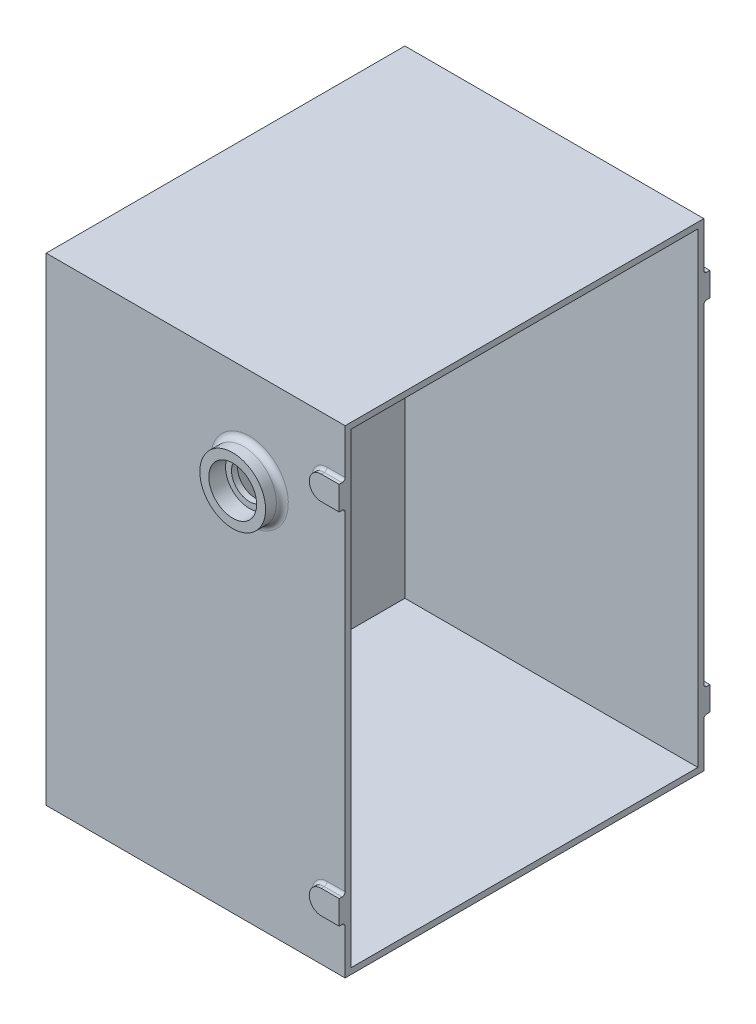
ISO-10303-21;
HEADER;
FILE_DESCRIPTION(('STEP AP214'),'2;1');
FILE_NAME('part.step','',(''),(''),'','','');
FILE_SCHEMA(('AUTOMOTIVE_DESIGN { 1 0 10303 214 1 1 1 1 }'));
ENDSEC;
DATA;
#1=APPLICATION_CONTEXT('core data for automotive mechanical design processes');
#2=APPLICATION_PROTOCOL_DEFINITION('international standard','automotive_design',2000,#1);
#3=PRODUCT_CONTEXT('',#1,'mechanical');
#4=PRODUCT('Part','Part','',(#3));
#5=PRODUCT_RELATED_PRODUCT_CATEGORY('part','',(#4));
#6=PRODUCT_DEFINITION_FORMATION('','',#4);
#7=PRODUCT_DEFINITION_CONTEXT('part definition',#1,'design');
#8=PRODUCT_DEFINITION('design','',#6,#7);
#9=PRODUCT_DEFINITION_SHAPE('','',#8);
#10=(LENGTH_UNIT() NAMED_UNIT(*) SI_UNIT(.MILLI.,.METRE.));
#11=(NAMED_UNIT(*) PLANE_ANGLE_UNIT() SI_UNIT($,.RADIAN.));
#12=(NAMED_UNIT(*) SI_UNIT($,.STERADIAN.) SOLID_ANGLE_UNIT());
#13=UNCERTAINTY_MEASURE_WITH_UNIT(LENGTH_MEASURE(1.E-05),#10,'distance_accuracy_value','');
#14=(GEOMETRIC_REPRESENTATION_CONTEXT(3) GLOBAL_UNCERTAINTY_ASSIGNED_CONTEXT((#13)) GLOBAL_UNIT_ASSIGNED_CONTEXT((#10,
#11,#12)) REPRESENTATION_CONTEXT('',''));
#15=CARTESIAN_POINT('',(0.,0.,0.));
#16=DIRECTION('',(0.,0.,1.));
#17=DIRECTION('',(1.,0.,0.));
#18=AXIS2_PLACEMENT_3D('',#15,#16,#17);
#19=CARTESIAN_POINT('',(170.,120.,150.));
#20=DIRECTION('',(0.,0.,1.));
#21=DIRECTION('',(1.,0.,0.));
#22=AXIS2_PLACEMENT_3D('',#19,#20,#21);
#23=CYLINDRICAL_SURFACE('',#22,20.);
#24=CARTESIAN_POINT('',(170.,120.,164.));
#25=DIRECTION('',(0.,0.,1.));
#26=DIRECTION('',(1.,0.,0.));
#27=AXIS2_PLACEMENT_3D('',#24,#25,#26);
#28=CIRCLE('',#27,20.);
#29=CARTESIAN_POINT('',(190.,120.,164.));
#30=VERTEX_POINT('',#29);
#31=EDGE_CURVE('E264',#30,#30,#28,.F.);
#32=ORIENTED_EDGE('',*,*,#31,.F.);
#33=EDGE_LOOP('',(#32));
#34=FACE_BOUND('',#33,.T.);
#35=CARTESIAN_POINT('',(170.,120.,150.));
#36=DIRECTION('',(0.,0.,1.));
#37=DIRECTION('',(1.,0.,0.));
#38=AXIS2_PLACEMENT_3D('',#35,#36,#37);
#39=CIRCLE('',#38,20.);
#40=CARTESIAN_POINT('',(190.,120.,150.));
#41=VERTEX_POINT('',#40);
#42=EDGE_CURVE('E267',#41,#41,#39,.T.);
#43=ORIENTED_EDGE('',*,*,#42,.F.);
#44=EDGE_LOOP('',(#43));
#45=FACE_BOUND('',#44,.T.);
#46=ADVANCED_FACE('F16',(#34,#45),#23,.F.);
#47=CARTESIAN_POINT('',(0.,200.,150.));
#48=DIRECTION('',(0.,0.,1.));
#49=DIRECTION('',(1.,0.,0.));
#50=AXIS2_PLACEMENT_3D('',#47,#48,#49);
#51=PLANE('',#50);
#52=CARTESIAN_POINT('',(170.,120.,150.));
#53=DIRECTION('',(0.,0.,1.));
#54=DIRECTION('',(1.,0.,0.));
#55=AXIS2_PLACEMENT_3D('',#52,#53,#54);
#56=CIRCLE('',#55,15.);
#57=CARTESIAN_POINT('',(185.,120.,150.));
#58=VERTEX_POINT('',#57);
#59=EDGE_CURVE('E261',#58,#58,#56,.F.);
#60=ORIENTED_EDGE('',*,*,#59,.T.);
#61=EDGE_LOOP('',(#60));
#62=FACE_BOUND('',#61,.T.);
#63=ORIENTED_EDGE('',*,*,#42,.T.);
#64=EDGE_LOOP('',(#63));
#65=FACE_BOUND('',#64,.T.);
#66=ADVANCED_FACE('F1182',(#62,#65),#51,.T.);
#67=CARTESIAN_POINT('',(0.,0.,164.));
#68=DIRECTION('',(0.,0.,1.));
#69=DIRECTION('',(1.,0.,0.));
#70=AXIS2_PLACEMENT_3D('',#67,#68,#69);
#71=PLANE('',#70);
#72=ORIENTED_EDGE('',*,*,#31,.T.);
#73=EDGE_LOOP('',(#72));
#74=FACE_BOUND('',#73,.T.);
#75=CARTESIAN_POINT('',(170.,120.,164.));
#76=DIRECTION('',(0.,0.,1.));
#77=DIRECTION('',(1.,0.,0.));
#78=AXIS2_PLACEMENT_3D('',#75,#76,#77);
#79=CIRCLE('',#78,27.5);
#80=CARTESIAN_POINT('',(197.5,120.,164.));
#81=VERTEX_POINT('',#80);
#82=EDGE_CURVE('E246',#81,#81,#79,.F.);
#83=ORIENTED_EDGE('',*,*,#82,.F.);
#84=EDGE_LOOP('',(#83));
#85=FACE_BOUND('',#84,.T.);
#86=ADVANCED_FACE('F1172',(#74,#85),#71,.T.);
#87=CARTESIAN_POINT('',(170.,120.,150.));
#88=DIRECTION('',(0.,0.,1.));
#89=DIRECTION('',(1.,0.,0.));
#90=AXIS2_PLACEMENT_3D('',#87,#88,#89);
#91=CYLINDRICAL_SURFACE('',#90,15.);
#92=CARTESIAN_POINT('',(170.,120.,145.));
#93=DIRECTION('',(0.,0.,1.));
#94=DIRECTION('',(1.,0.,0.));
#95=AXIS2_PLACEMENT_3D('',#92,#93,#94);
#96=CIRCLE('',#95,15.);
#97=CARTESIAN_POINT('',(185.,120.,145.));
#98=VERTEX_POINT('',#97);
#99=EDGE_CURVE('E331',#98,#98,#96,.T.);
#100=ORIENTED_EDGE('',*,*,#99,.F.);
#101=EDGE_LOOP('',(#100));
#102=FACE_BOUND('',#101,.T.);
#103=ORIENTED_EDGE('',*,*,#59,.F.);
#104=EDGE_LOOP('',(#103));
#105=FACE_BOUND('',#104,.T.);
#106=ADVANCED_FACE('F1162',(#102,#105),#91,.F.);
#107=CARTESIAN_POINT('',(5.,0.,0.));
#108=DIRECTION('',(1.,0.,0.));
#109=DIRECTION('',(0.,0.,-1.));
#110=AXIS2_PLACEMENT_3D('',#107,#108,#109);
#111=PLANE('',#110);
#112=DIRECTION('',(0.,1.,0.));
#113=VECTOR('',#112,1.);
#114=CARTESIAN_POINT('',(5.,195.,-145.));
#115=LINE('',#114,#113);
#116=CARTESIAN_POINT('',(5.,195.,-145.));
#117=VERTEX_POINT('',#116);
#118=CARTESIAN_POINT('',(5.,-195.,-145.));
#119=VERTEX_POINT('',#118);
#120=EDGE_CURVE('E407',#117,#119,#115,.F.);
#121=ORIENTED_EDGE('',*,*,#120,.F.);
#122=DIRECTION('',(0.,0.,-1.));
#123=VECTOR('',#122,1.);
#124=CARTESIAN_POINT('',(5.,195.,145.));
#125=LINE('',#124,#123);
#126=CARTESIAN_POINT('',(5.,195.,145.));
#127=VERTEX_POINT('',#126);
#128=EDGE_CURVE('E334',#127,#117,#125,.T.);
#129=ORIENTED_EDGE('',*,*,#128,.F.);
#130=DIRECTION('',(0.,1.,0.));
#131=VECTOR('',#130,1.);
#132=CARTESIAN_POINT('',(5.,-195.,145.));
#133=LINE('',#132,#131);
#134=CARTESIAN_POINT('',(5.,-195.,145.));
#135=VERTEX_POINT('',#134);
#136=EDGE_CURVE('E335',#135,#127,#133,.T.);
#137=ORIENTED_EDGE('',*,*,#136,.F.);
#138=DIRECTION('',(0.,0.,1.));
#139=VECTOR('',#138,1.);
#140=CARTESIAN_POINT('',(5.,-195.,-145.));
#141=LINE('',#140,#139);
#142=EDGE_CURVE('E491',#119,#135,#141,.T.);
#143=ORIENTED_EDGE('',*,*,#142,.F.);
#144=EDGE_LOOP('',(#121,#129,#137,#143));
#145=FACE_BOUND('',#144,.T.);
#146=ADVANCED_FACE('F1153',(#145),#111,.T.);
#147=CARTESIAN_POINT('',(235.,-150.,150.));
#148=DIRECTION('',(0.,0.,-1.));
#149=DIRECTION('',(-1.,0.,0.));
#150=AXIS2_PLACEMENT_3D('',#147,#148,#149);
#151=CYLINDRICAL_SURFACE('',#150,10.);
#152=DIRECTION('',(0.,0.,-1.));
#153=VECTOR('',#152,1.);
#154=CARTESIAN_POINT('',(235.,-140.,150.));
#155=LINE('',#154,#153);
#156=CARTESIAN_POINT('',(235.,-140.,155.));
#157=VERTEX_POINT('',#156);
#158=CARTESIAN_POINT('',(235.,-140.,152.5));
#159=VERTEX_POINT('',#158);
#160=EDGE_CURVE('E342',#157,#159,#155,.T.);
#161=ORIENTED_EDGE('',*,*,#160,.T.);
#162=CARTESIAN_POINT('',(235.,-150.,152.5));
#163=DIRECTION('',(0.,0.,-1.));
#164=DIRECTION('',(0.123456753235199,0.992349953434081,0.));
#165=AXIS2_PLACEMENT_3D('',#162,#163,#164);
#166=CIRCLE('',#165,10.);
#167=CARTESIAN_POINT('',(235.0000000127,-160.,152.5));
#168=VERTEX_POINT('',#167);
#169=EDGE_CURVE('E371',#159,#168,#166,.F.);
#170=ORIENTED_EDGE('',*,*,#169,.T.);
#171=DIRECTION('',(0.,0.,1.));
#172=VECTOR('',#171,1.);
#173=CARTESIAN_POINT('',(235.0000000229,-160.,150.));
#174=LINE('',#173,#172);
#175=CARTESIAN_POINT('',(235.00000001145,-160.,155.));
#176=VERTEX_POINT('',#175);
#177=EDGE_CURVE('E347',#168,#176,#174,.T.);
#178=ORIENTED_EDGE('',*,*,#177,.T.);
#179=CARTESIAN_POINT('',(235.,-150.,155.));
#180=DIRECTION('',(0.,0.,-1.));
#181=DIRECTION('',(-1.,0.,0.));
#182=AXIS2_PLACEMENT_3D('',#179,#180,#181);
#183=CIRCLE('',#182,10.);
#184=EDGE_CURVE('E339',#176,#157,#183,.T.);
#185=ORIENTED_EDGE('',*,*,#184,.T.);
#186=EDGE_LOOP('',(#161,#170,#178,#185));
#187=FACE_BOUND('',#186,.T.);
#188=ADVANCED_FACE('F1144',(#187),#151,.T.);
#189=CARTESIAN_POINT('',(235.,150.,150.));
#190=DIRECTION('',(0.,0.,1.));
#191=DIRECTION('',(1.,0.,0.));
#192=AXIS2_PLACEMENT_3D('',#189,#190,#191);
#193=CYLINDRICAL_SURFACE('',#192,10.);
#194=DIRECTION('',(0.,0.,1.));
#195=VECTOR('',#194,1.);
#196=CARTESIAN_POINT('',(235.,160.,150.));
#197=LINE('',#196,#195);
#198=CARTESIAN_POINT('',(235.,160.,152.5));
#199=VERTEX_POINT('',#198);
#200=CARTESIAN_POINT('',(235.,160.,155.));
#201=VERTEX_POINT('',#200);
#202=EDGE_CURVE('E359',#199,#201,#197,.T.);
#203=ORIENTED_EDGE('',*,*,#202,.F.);
#204=CARTESIAN_POINT('',(235.,150.,152.5));
#205=DIRECTION('',(0.,0.,1.));
#206=DIRECTION('',(0.0870194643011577,0.996206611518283,0.));
#207=AXIS2_PLACEMENT_3D('',#204,#205,#206);
#208=CIRCLE('',#207,10.);
#209=CARTESIAN_POINT('',(235.00000000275,140.,152.5));
#210=VERTEX_POINT('',#209);
#211=EDGE_CURVE('E364',#199,#210,#208,.T.);
#212=ORIENTED_EDGE('',*,*,#211,.T.);
#213=DIRECTION('',(0.,0.,-1.));
#214=VECTOR('',#213,1.);
#215=CARTESIAN_POINT('',(235.,140.,150.));
#216=LINE('',#215,#214);
#217=CARTESIAN_POINT('',(235.,140.,155.));
#218=VERTEX_POINT('',#217);
#219=EDGE_CURVE('E349',#218,#210,#216,.T.);
#220=ORIENTED_EDGE('',*,*,#219,.F.);
#221=CARTESIAN_POINT('',(235.,150.,155.));
#222=DIRECTION('',(0.,0.,1.));
#223=DIRECTION('',(1.,0.,0.));
#224=AXIS2_PLACEMENT_3D('',#221,#222,#223);
#225=CIRCLE('',#224,10.);
#226=EDGE_CURVE('E257',#201,#218,#225,.T.);
#227=ORIENTED_EDGE('',*,*,#226,.F.);
#228=EDGE_LOOP('',(#203,#212,#220,#227));
#229=FACE_BOUND('',#228,.T.);
#230=ADVANCED_FACE('F839',(#229),#193,.T.);
#231=CARTESIAN_POINT('',(170.,120.,150.));
#232=DIRECTION('',(0.,0.,1.));
#233=DIRECTION('',(1.,0.,0.));
#234=AXIS2_PLACEMENT_3D('',#231,#232,#233);
#235=CYLINDRICAL_SURFACE('',#234,27.5);
#236=ORIENTED_EDGE('',*,*,#82,.T.);
#237=EDGE_LOOP('',(#236));
#238=FACE_BOUND('',#237,.T.);
#239=CARTESIAN_POINT('',(170.,120.,155.));
#240=DIRECTION('',(0.,0.,1.));
#241=DIRECTION('',(0.0316782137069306,0.999498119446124,0.));
#242=AXIS2_PLACEMENT_3D('',#239,#240,#241);
#243=CIRCLE('',#242,27.5);
#244=CARTESIAN_POINT('',(170.871150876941,147.486198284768,155.));
#245=VERTEX_POINT('',#244);
#246=EDGE_CURVE('E379',#245,#245,#243,.T.);
#247=ORIENTED_EDGE('',*,*,#246,.T.);
#248=EDGE_LOOP('',(#247));
#249=FACE_BOUND('',#248,.T.);
#250=ADVANCED_FACE('F1125',(#238,#249),#235,.T.);
#251=CARTESIAN_POINT('',(235.,-150.,-150.));
#252=DIRECTION('',(0.,0.,-1.));
#253=DIRECTION('',(-1.,0.,0.));
#254=AXIS2_PLACEMENT_3D('',#251,#252,#253);
#255=CYLINDRICAL_SURFACE('',#254,10.);
#256=DIRECTION('',(0.,0.,-1.));
#257=VECTOR('',#256,1.);
#258=CARTESIAN_POINT('',(235.,-160.,-150.));
#259=LINE('',#258,#257);
#260=CARTESIAN_POINT('',(235.,-160.,-152.5));
#261=VERTEX_POINT('',#260);
#262=CARTESIAN_POINT('',(235.,-160.,-155.));
#263=VERTEX_POINT('',#262);
#264=EDGE_CURVE('E338',#261,#263,#259,.T.);
#265=ORIENTED_EDGE('',*,*,#264,.F.);
#266=CARTESIAN_POINT('',(235.,-150.,-152.5));
#267=DIRECTION('',(0.,0.,-1.));
#268=DIRECTION('',(0.0874461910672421,-0.996169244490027,0.));
#269=AXIS2_PLACEMENT_3D('',#266,#267,#268);
#270=CIRCLE('',#269,10.);
#271=CARTESIAN_POINT('',(235.000000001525,-140.,-152.5));
#272=VERTEX_POINT('',#271);
#273=EDGE_CURVE('E382',#261,#272,#270,.T.);
#274=ORIENTED_EDGE('',*,*,#273,.T.);
#275=DIRECTION('',(0.,0.,1.));
#276=VECTOR('',#275,1.);
#277=CARTESIAN_POINT('',(235.,-140.,-150.));
#278=LINE('',#277,#276);
#279=CARTESIAN_POINT('',(235.,-140.,-155.));
#280=VERTEX_POINT('',#279);
#281=EDGE_CURVE('E405',#280,#272,#278,.T.);
#282=ORIENTED_EDGE('',*,*,#281,.F.);
#283=CARTESIAN_POINT('',(235.,-150.,-155.));
#284=DIRECTION('',(0.,0.,-1.));
#285=DIRECTION('',(-1.,0.,0.));
#286=AXIS2_PLACEMENT_3D('',#283,#284,#285);
#287=CIRCLE('',#286,10.);
#288=EDGE_CURVE('E336',#263,#280,#287,.T.);
#289=ORIENTED_EDGE('',*,*,#288,.F.);
#290=EDGE_LOOP('',(#265,#274,#282,#289));
#291=FACE_BOUND('',#290,.T.);
#292=ADVANCED_FACE('F1116',(#291),#255,.T.);
#293=CARTESIAN_POINT('',(235.,150.,-150.));
#294=DIRECTION('',(0.,0.,1.));
#295=DIRECTION('',(1.,0.,0.));
#296=AXIS2_PLACEMENT_3D('',#293,#294,#295);
#297=CYLINDRICAL_SURFACE('',#296,10.);
#298=DIRECTION('',(0.,0.,1.));
#299=VECTOR('',#298,1.);
#300=CARTESIAN_POINT('',(235.,140.,-150.));
#301=LINE('',#300,#299);
#302=CARTESIAN_POINT('',(235.,140.,-155.));
#303=VERTEX_POINT('',#302);
#304=CARTESIAN_POINT('',(235.,140.,-152.5));
#305=VERTEX_POINT('',#304);
#306=EDGE_CURVE('E237',#303,#305,#301,.T.);
#307=ORIENTED_EDGE('',*,*,#306,.T.);
#308=CARTESIAN_POINT('',(235.,150.,-152.5));
#309=DIRECTION('',(0.,0.,1.));
#310=DIRECTION('',(0.124060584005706,-0.992274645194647,0.));
#311=AXIS2_PLACEMENT_3D('',#308,#309,#310);
#312=CIRCLE('',#311,10.);
#313=CARTESIAN_POINT('',(235.000000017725,160.,-152.5));
#314=VERTEX_POINT('',#313);
#315=EDGE_CURVE('E394',#305,#314,#312,.F.);
#316=ORIENTED_EDGE('',*,*,#315,.T.);
#317=DIRECTION('',(0.,0.,-1.));
#318=VECTOR('',#317,1.);
#319=CARTESIAN_POINT('',(235.0000000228,160.,-150.));
#320=LINE('',#319,#318);
#321=CARTESIAN_POINT('',(235.0000000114,160.,-155.));
#322=VERTEX_POINT('',#321);
#323=EDGE_CURVE('E250',#314,#322,#320,.T.);
#324=ORIENTED_EDGE('',*,*,#323,.T.);
#325=CARTESIAN_POINT('',(235.,150.,-155.));
#326=DIRECTION('',(0.,0.,1.));
#327=DIRECTION('',(1.,0.,0.));
#328=AXIS2_PLACEMENT_3D('',#325,#326,#327);
#329=CIRCLE('',#328,10.);
#330=EDGE_CURVE('E230',#322,#303,#329,.T.);
#331=ORIENTED_EDGE('',*,*,#330,.T.);
#332=EDGE_LOOP('',(#307,#316,#324,#331));
#333=FACE_BOUND('',#332,.T.);
#334=ADVANCED_FACE('F253',(#333),#297,.T.);
#335=CARTESIAN_POINT('',(235.,140.,-150.));
#336=DIRECTION('',(0.,1.,0.));
#337=DIRECTION('',(0.,0.,1.));
#338=AXIS2_PLACEMENT_3D('',#335,#336,#337);
#339=PLANE('',#338);
#340=DIRECTION('',(1.,0.,0.));
#341=VECTOR('',#340,1.);
#342=CARTESIAN_POINT('',(0.,140.,-155.));
#343=LINE('',#342,#341);
#344=CARTESIAN_POINT('',(250.,140.,-155.));
#345=VERTEX_POINT('',#344);
#346=EDGE_CURVE('E240',#303,#345,#343,.T.);
#347=ORIENTED_EDGE('',*,*,#346,.T.);
#348=DIRECTION('',(0.,0.,-1.));
#349=VECTOR('',#348,1.);
#350=CARTESIAN_POINT('',(250.,140.,0.));
#351=LINE('',#350,#349);
#352=CARTESIAN_POINT('',(250.,140.,-152.5));
#353=VERTEX_POINT('',#352);
#354=EDGE_CURVE('E329',#353,#345,#351,.T.);
#355=ORIENTED_EDGE('',*,*,#354,.F.);
#356=DIRECTION('',(-1.,0.,0.));
#357=VECTOR('',#356,1.);
#358=CARTESIAN_POINT('',(575.9,140.,-152.5));
#359=LINE('',#358,#357);
#360=EDGE_CURVE('E242',#353,#305,#359,.T.);
#361=ORIENTED_EDGE('',*,*,#360,.T.);
#362=ORIENTED_EDGE('',*,*,#306,.F.);
#363=EDGE_LOOP('',(#347,#355,#361,#362));
#364=FACE_BOUND('',#363,.T.);
#365=ADVANCED_FACE('F238',(#364),#339,.F.);
#366=CARTESIAN_POINT('',(0.,0.,-155.));
#367=DIRECTION('',(0.,0.,1.));
#368=DIRECTION('',(1.,0.,0.));
#369=AXIS2_PLACEMENT_3D('',#366,#367,#368);
#370=PLANE('',#369);
#371=ORIENTED_EDGE('',*,*,#346,.F.);
#372=ORIENTED_EDGE('',*,*,#330,.F.);
#373=DIRECTION('',(1.,0.,0.));
#374=VECTOR('',#373,1.);
#375=CARTESIAN_POINT('',(250.,160.,-155.));
#376=LINE('',#375,#374);
#377=CARTESIAN_POINT('',(250.,160.,-155.));
#378=VERTEX_POINT('',#377);
#379=EDGE_CURVE('E361',#322,#378,#376,.T.);
#380=ORIENTED_EDGE('',*,*,#379,.T.);
#381=DIRECTION('',(0.,1.,0.));
#382=VECTOR('',#381,1.);
#383=CARTESIAN_POINT('',(250.,0.,-155.));
#384=LINE('',#383,#382);
#385=EDGE_CURVE('E249',#345,#378,#384,.T.);
#386=ORIENTED_EDGE('',*,*,#385,.F.);
#387=EDGE_LOOP('',(#371,#372,#380,#386));
#388=FACE_BOUND('',#387,.T.);
#389=ADVANCED_FACE('F248',(#388),#370,.F.);
#390=CARTESIAN_POINT('',(250.,160.,-150.));
#391=DIRECTION('',(0.,-1.,0.));
#392=DIRECTION('',(0.,0.,-1.));
#393=AXIS2_PLACEMENT_3D('',#390,#391,#392);
#394=PLANE('',#393);
#395=ORIENTED_EDGE('',*,*,#379,.F.);
#396=ORIENTED_EDGE('',*,*,#323,.F.);
#397=DIRECTION('',(1.,0.,0.));
#398=VECTOR('',#397,1.);
#399=CARTESIAN_POINT('',(233.7561895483,160.,-152.5));
#400=LINE('',#399,#398);
#401=CARTESIAN_POINT('',(250.,160.,-152.5));
#402=VERTEX_POINT('',#401);
#403=EDGE_CURVE('E397',#314,#402,#400,.T.);
#404=ORIENTED_EDGE('',*,*,#403,.T.);
#405=DIRECTION('',(0.,0.,-1.));
#406=VECTOR('',#405,1.);
#407=CARTESIAN_POINT('',(250.,160.,0.));
#408=LINE('',#407,#406);
#409=EDGE_CURVE('E325',#378,#402,#408,.F.);
#410=ORIENTED_EDGE('',*,*,#409,.F.);
#411=EDGE_LOOP('',(#395,#396,#404,#410));
#412=FACE_BOUND('',#411,.T.);
#413=ADVANCED_FACE('F1082',(#412),#394,.F.);
#414=CARTESIAN_POINT('',(250.,160.,150.));
#415=DIRECTION('',(0.,1.,0.));
#416=DIRECTION('',(0.,0.,1.));
#417=AXIS2_PLACEMENT_3D('',#414,#415,#416);
#418=PLANE('',#417);
#419=DIRECTION('',(0.,0.,-1.));
#420=VECTOR('',#419,1.);
#421=CARTESIAN_POINT('',(250.,160.,0.));
#422=LINE('',#421,#420);
#423=CARTESIAN_POINT('',(250.,160.,152.5));
#424=VERTEX_POINT('',#423);
#425=CARTESIAN_POINT('',(250.,160.,155.));
#426=VERTEX_POINT('',#425);
#427=EDGE_CURVE('E322',#424,#426,#422,.F.);
#428=ORIENTED_EDGE('',*,*,#427,.F.);
#429=DIRECTION('',(-1.,0.,0.));
#430=VECTOR('',#429,1.);
#431=CARTESIAN_POINT('',(575.9,160.,152.5));
#432=LINE('',#431,#430);
#433=EDGE_CURVE('E428',#424,#199,#432,.T.);
#434=ORIENTED_EDGE('',*,*,#433,.T.);
#435=ORIENTED_EDGE('',*,*,#202,.T.);
#436=DIRECTION('',(1.,0.,0.));
#437=VECTOR('',#436,1.);
#438=CARTESIAN_POINT('',(0.,160.,155.));
#439=LINE('',#438,#437);
#440=EDGE_CURVE('E434',#426,#201,#439,.F.);
#441=ORIENTED_EDGE('',*,*,#440,.F.);
#442=EDGE_LOOP('',(#428,#434,#435,#441));
#443=FACE_BOUND('',#442,.T.);
#444=ADVANCED_FACE('F843',(#443),#418,.T.);
#445=CARTESIAN_POINT('',(0.,0.,155.));
#446=DIRECTION('',(0.,0.,1.));
#447=DIRECTION('',(1.,0.,0.));
#448=AXIS2_PLACEMENT_3D('',#445,#446,#447);
#449=PLANE('',#448);
#450=DIRECTION('',(0.,1.,0.));
#451=VECTOR('',#450,1.);
#452=CARTESIAN_POINT('',(250.,0.,155.));
#453=LINE('',#452,#451);
#454=CARTESIAN_POINT('',(250.,140.,155.));
#455=VERTEX_POINT('',#454);
#456=EDGE_CURVE('E439',#426,#455,#453,.F.);
#457=ORIENTED_EDGE('',*,*,#456,.F.);
#458=ORIENTED_EDGE('',*,*,#440,.T.);
#459=ORIENTED_EDGE('',*,*,#226,.T.);
#460=DIRECTION('',(1.,0.,0.));
#461=VECTOR('',#460,1.);
#462=CARTESIAN_POINT('',(235.,140.,155.));
#463=LINE('',#462,#461);
#464=EDGE_CURVE('E352',#455,#218,#463,.F.);
#465=ORIENTED_EDGE('',*,*,#464,.F.);
#466=EDGE_LOOP('',(#457,#458,#459,#465));
#467=FACE_BOUND('',#466,.T.);
#468=ADVANCED_FACE('F846',(#467),#449,.T.);
#469=CARTESIAN_POINT('',(235.,140.,150.));
#470=DIRECTION('',(0.,-1.,0.));
#471=DIRECTION('',(0.,0.,-1.));
#472=AXIS2_PLACEMENT_3D('',#469,#470,#471);
#473=PLANE('',#472);
#474=ORIENTED_EDGE('',*,*,#219,.T.);
#475=DIRECTION('',(1.,0.,0.));
#476=VECTOR('',#475,1.);
#477=CARTESIAN_POINT('',(234.1287033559,140.,152.5));
#478=LINE('',#477,#476);
#479=CARTESIAN_POINT('',(250.,140.,152.5));
#480=VERTEX_POINT('',#479);
#481=EDGE_CURVE('E368',#210,#480,#478,.T.);
#482=ORIENTED_EDGE('',*,*,#481,.T.);
#483=DIRECTION('',(0.,0.,-1.));
#484=VECTOR('',#483,1.);
#485=CARTESIAN_POINT('',(250.,140.,0.));
#486=LINE('',#485,#484);
#487=EDGE_CURVE('E318',#455,#480,#486,.T.);
#488=ORIENTED_EDGE('',*,*,#487,.F.);
#489=ORIENTED_EDGE('',*,*,#464,.T.);
#490=EDGE_LOOP('',(#474,#482,#488,#489));
#491=FACE_BOUND('',#490,.T.);
#492=ADVANCED_FACE('F850',(#491),#473,.T.);
#493=CARTESIAN_POINT('',(235.,-140.,150.));
#494=DIRECTION('',(0.,-1.,0.));
#495=DIRECTION('',(0.,0.,-1.));
#496=AXIS2_PLACEMENT_3D('',#493,#494,#495);
#497=PLANE('',#496);
#498=DIRECTION('',(-1.,0.,0.));
#499=VECTOR('',#498,1.);
#500=CARTESIAN_POINT('',(0.,-140.,155.));
#501=LINE('',#500,#499);
#502=CARTESIAN_POINT('',(250.,-140.,155.));
#503=VERTEX_POINT('',#502);
#504=EDGE_CURVE('E341',#157,#503,#501,.F.);
#505=ORIENTED_EDGE('',*,*,#504,.T.);
#506=DIRECTION('',(0.,0.,-1.));
#507=VECTOR('',#506,1.);
#508=CARTESIAN_POINT('',(250.,-140.,0.));
#509=LINE('',#508,#507);
#510=CARTESIAN_POINT('',(250.,-140.,152.5));
#511=VERTEX_POINT('',#510);
#512=EDGE_CURVE('E315',#511,#503,#509,.F.);
#513=ORIENTED_EDGE('',*,*,#512,.F.);
#514=DIRECTION('',(-1.,0.,0.));
#515=VECTOR('',#514,1.);
#516=CARTESIAN_POINT('',(575.9,-140.,152.5));
#517=LINE('',#516,#515);
#518=EDGE_CURVE('E373',#511,#159,#517,.T.);
#519=ORIENTED_EDGE('',*,*,#518,.T.);
#520=ORIENTED_EDGE('',*,*,#160,.F.);
#521=EDGE_LOOP('',(#505,#513,#519,#520));
#522=FACE_BOUND('',#521,.T.);
#523=ADVANCED_FACE('F852',(#522),#497,.F.);
#524=CARTESIAN_POINT('',(0.,0.,155.));
#525=DIRECTION('',(0.,0.,-1.));
#526=DIRECTION('',(-1.,0.,0.));
#527=AXIS2_PLACEMENT_3D('',#524,#525,#526);
#528=PLANE('',#527);
#529=ORIENTED_EDGE('',*,*,#504,.F.);
#530=ORIENTED_EDGE('',*,*,#184,.F.);
#531=DIRECTION('',(1.,0.,0.));
#532=VECTOR('',#531,1.);
#533=CARTESIAN_POINT('',(250.,-160.,155.));
#534=LINE('',#533,#532);
#535=CARTESIAN_POINT('',(250.,-160.,155.));
#536=VERTEX_POINT('',#535);
#537=EDGE_CURVE('E378',#176,#536,#534,.T.);
#538=ORIENTED_EDGE('',*,*,#537,.T.);
#539=DIRECTION('',(0.,1.,0.));
#540=VECTOR('',#539,1.);
#541=CARTESIAN_POINT('',(250.,0.,155.));
#542=LINE('',#541,#540);
#543=EDGE_CURVE('E458',#503,#536,#542,.F.);
#544=ORIENTED_EDGE('',*,*,#543,.F.);
#545=EDGE_LOOP('',(#529,#530,#538,#544));
#546=FACE_BOUND('',#545,.T.);
#547=ADVANCED_FACE('F860',(#546),#528,.F.);
#548=CARTESIAN_POINT('',(250.,-160.,150.));
#549=DIRECTION('',(0.,1.,0.));
#550=DIRECTION('',(0.,0.,1.));
#551=AXIS2_PLACEMENT_3D('',#548,#549,#550);
#552=PLANE('',#551);
#553=ORIENTED_EDGE('',*,*,#537,.F.);
#554=ORIENTED_EDGE('',*,*,#177,.F.);
#555=DIRECTION('',(1.,0.,0.));
#556=VECTOR('',#555,1.);
#557=CARTESIAN_POINT('',(233.7622746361,-160.,152.5));
#558=LINE('',#557,#556);
#559=CARTESIAN_POINT('',(250.,-160.,152.5));
#560=VERTEX_POINT('',#559);
#561=EDGE_CURVE('E383',#168,#560,#558,.T.);
#562=ORIENTED_EDGE('',*,*,#561,.T.);
#563=DIRECTION('',(0.,0.,-1.));
#564=VECTOR('',#563,1.);
#565=CARTESIAN_POINT('',(250.,-160.,0.));
#566=LINE('',#565,#564);
#567=EDGE_CURVE('E311',#536,#560,#566,.T.);
#568=ORIENTED_EDGE('',*,*,#567,.F.);
#569=EDGE_LOOP('',(#553,#554,#562,#568));
#570=FACE_BOUND('',#569,.T.);
#571=ADVANCED_FACE('F1039',(#570),#552,.F.);
#572=CARTESIAN_POINT('',(250.,-160.,-150.));
#573=DIRECTION('',(0.,-1.,0.));
#574=DIRECTION('',(0.,0.,-1.));
#575=AXIS2_PLACEMENT_3D('',#572,#573,#574);
#576=PLANE('',#575);
#577=DIRECTION('',(0.,0.,-1.));
#578=VECTOR('',#577,1.);
#579=CARTESIAN_POINT('',(250.,-160.,0.));
#580=LINE('',#579,#578);
#581=CARTESIAN_POINT('',(250.,-160.,-152.5));
#582=VERTEX_POINT('',#581);
#583=CARTESIAN_POINT('',(250.,-160.,-155.));
#584=VERTEX_POINT('',#583);
#585=EDGE_CURVE('E308',#582,#584,#580,.T.);
#586=ORIENTED_EDGE('',*,*,#585,.F.);
#587=DIRECTION('',(-1.,0.,0.));
#588=VECTOR('',#587,1.);
#589=CARTESIAN_POINT('',(575.9,-160.,-152.5));
#590=LINE('',#589,#588);
#591=EDGE_CURVE('E402',#582,#261,#590,.T.);
#592=ORIENTED_EDGE('',*,*,#591,.T.);
#593=ORIENTED_EDGE('',*,*,#264,.T.);
#594=DIRECTION('',(-1.,0.,0.));
#595=VECTOR('',#594,1.);
#596=CARTESIAN_POINT('',(0.,-160.,-155.));
#597=LINE('',#596,#595);
#598=EDGE_CURVE('E337',#584,#263,#597,.T.);
#599=ORIENTED_EDGE('',*,*,#598,.F.);
#600=EDGE_LOOP('',(#586,#592,#593,#599));
#601=FACE_BOUND('',#600,.T.);
#602=ADVANCED_FACE('F1030',(#601),#576,.T.);
#603=CARTESIAN_POINT('',(0.,0.,-155.));
#604=DIRECTION('',(0.,0.,-1.));
#605=DIRECTION('',(-1.,0.,0.));
#606=AXIS2_PLACEMENT_3D('',#603,#604,#605);
#607=PLANE('',#606);
#608=DIRECTION('',(0.,1.,0.));
#609=VECTOR('',#608,1.);
#610=CARTESIAN_POINT('',(250.,0.,-155.));
#611=LINE('',#610,#609);
#612=CARTESIAN_POINT('',(250.,-140.,-155.));
#613=VERTEX_POINT('',#612);
#614=EDGE_CURVE('E479',#584,#613,#611,.T.);
#615=ORIENTED_EDGE('',*,*,#614,.F.);
#616=ORIENTED_EDGE('',*,*,#598,.T.);
#617=ORIENTED_EDGE('',*,*,#288,.T.);
#618=DIRECTION('',(1.,0.,0.));
#619=VECTOR('',#618,1.);
#620=CARTESIAN_POINT('',(235.,-140.,-155.));
#621=LINE('',#620,#619);
#622=EDGE_CURVE('E408',#613,#280,#621,.F.);
#623=ORIENTED_EDGE('',*,*,#622,.F.);
#624=EDGE_LOOP('',(#615,#616,#617,#623));
#625=FACE_BOUND('',#624,.T.);
#626=ADVANCED_FACE('F1021',(#625),#607,.T.);
#627=CARTESIAN_POINT('',(235.,-140.,-150.));
#628=DIRECTION('',(0.,1.,0.));
#629=DIRECTION('',(0.,0.,1.));
#630=AXIS2_PLACEMENT_3D('',#627,#628,#629);
#631=PLANE('',#630);
#632=ORIENTED_EDGE('',*,*,#281,.T.);
#633=DIRECTION('',(1.,0.,0.));
#634=VECTOR('',#633,1.);
#635=CARTESIAN_POINT('',(234.1244197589,-140.,-152.5));
#636=LINE('',#635,#634);
#637=CARTESIAN_POINT('',(250.,-140.,-152.5));
#638=VERTEX_POINT('',#637);
#639=EDGE_CURVE('E330',#272,#638,#636,.T.);
#640=ORIENTED_EDGE('',*,*,#639,.T.);
#641=DIRECTION('',(0.,0.,-1.));
#642=VECTOR('',#641,1.);
#643=CARTESIAN_POINT('',(250.,-140.,0.));
#644=LINE('',#643,#642);
#645=EDGE_CURVE('E304',#613,#638,#644,.F.);
#646=ORIENTED_EDGE('',*,*,#645,.F.);
#647=ORIENTED_EDGE('',*,*,#622,.T.);
#648=EDGE_LOOP('',(#632,#640,#646,#647));
#649=FACE_BOUND('',#648,.T.);
#650=ADVANCED_FACE('F1012',(#649),#631,.T.);
#651=CARTESIAN_POINT('',(0.,195.,-145.));
#652=DIRECTION('',(0.,0.,1.));
#653=DIRECTION('',(1.,0.,0.));
#654=AXIS2_PLACEMENT_3D('',#651,#652,#653);
#655=PLANE('',#654);
#656=DIRECTION('',(0.,1.,0.));
#657=VECTOR('',#656,1.);
#658=CARTESIAN_POINT('',(250.,0.,-145.));
#659=LINE('',#658,#657);
#660=CARTESIAN_POINT('',(250.,195.,-145.));
#661=VERTEX_POINT('',#660);
#662=CARTESIAN_POINT('',(250.,-195.,-145.));
#663=VERTEX_POINT('',#662);
#664=EDGE_CURVE('E303',#661,#663,#659,.F.);
#665=ORIENTED_EDGE('',*,*,#664,.F.);
#666=DIRECTION('',(1.,0.,0.));
#667=VECTOR('',#666,1.);
#668=CARTESIAN_POINT('',(0.,195.,-145.));
#669=LINE('',#668,#667);
#670=EDGE_CURVE('E501',#117,#661,#669,.T.);
#671=ORIENTED_EDGE('',*,*,#670,.F.);
#672=ORIENTED_EDGE('',*,*,#120,.T.);
#673=DIRECTION('',(1.,0.,0.));
#674=VECTOR('',#673,1.);
#675=CARTESIAN_POINT('',(0.,-195.,-145.));
#676=LINE('',#675,#674);
#677=EDGE_CURVE('E493',#663,#119,#676,.F.);
#678=ORIENTED_EDGE('',*,*,#677,.F.);
#679=EDGE_LOOP('',(#665,#671,#672,#678));
#680=FACE_BOUND('',#679,.T.);
#681=ADVANCED_FACE('F1003',(#680),#655,.T.);
#682=CARTESIAN_POINT('',(0.,-195.,-145.));
#683=DIRECTION('',(0.,1.,0.));
#684=DIRECTION('',(0.,0.,1.));
#685=AXIS2_PLACEMENT_3D('',#682,#683,#684);
#686=PLANE('',#685);
#687=DIRECTION('',(0.,0.,-1.));
#688=VECTOR('',#687,1.);
#689=CARTESIAN_POINT('',(250.,-195.,0.));
#690=LINE('',#689,#688);
#691=CARTESIAN_POINT('',(250.,-195.,145.));
#692=VERTEX_POINT('',#691);
#693=EDGE_CURVE('E709',#663,#692,#690,.F.);
#694=ORIENTED_EDGE('',*,*,#693,.F.);
#695=ORIENTED_EDGE('',*,*,#677,.T.);
#696=ORIENTED_EDGE('',*,*,#142,.T.);
#697=DIRECTION('',(-1.,0.,0.));
#698=VECTOR('',#697,1.);
#699=CARTESIAN_POINT('',(0.,-195.,145.));
#700=LINE('',#699,#698);
#701=EDGE_CURVE('E496',#692,#135,#700,.T.);
#702=ORIENTED_EDGE('',*,*,#701,.F.);
#703=EDGE_LOOP('',(#694,#695,#696,#702));
#704=FACE_BOUND('',#703,.T.);
#705=ADVANCED_FACE('F995',(#704),#686,.T.);
#706=CARTESIAN_POINT('',(0.,-195.,145.));
#707=DIRECTION('',(0.,0.,-1.));
#708=DIRECTION('',(-1.,0.,0.));
#709=AXIS2_PLACEMENT_3D('',#706,#707,#708);
#710=PLANE('',#709);
#711=ORIENTED_EDGE('',*,*,#99,.T.);
#712=EDGE_LOOP('',(#711));
#713=FACE_BOUND('',#712,.T.);
#714=ORIENTED_EDGE('',*,*,#136,.T.);
#715=DIRECTION('',(1.,0.,0.));
#716=VECTOR('',#715,1.);
#717=CARTESIAN_POINT('',(0.,195.,145.));
#718=LINE('',#717,#716);
#719=CARTESIAN_POINT('',(250.,195.,145.));
#720=VERTEX_POINT('',#719);
#721=EDGE_CURVE('E374',#720,#127,#718,.F.);
#722=ORIENTED_EDGE('',*,*,#721,.F.);
#723=DIRECTION('',(0.,1.,0.));
#724=VECTOR('',#723,1.);
#725=CARTESIAN_POINT('',(250.,0.,145.));
#726=LINE('',#725,#724);
#727=EDGE_CURVE('E711',#692,#720,#726,.T.);
#728=ORIENTED_EDGE('',*,*,#727,.F.);
#729=ORIENTED_EDGE('',*,*,#701,.T.);
#730=EDGE_LOOP('',(#714,#722,#728,#729));
#731=FACE_BOUND('',#730,.T.);
#732=ADVANCED_FACE('F987',(#713,#731),#710,.T.);
#733=CARTESIAN_POINT('',(0.,195.,145.));
#734=DIRECTION('',(0.,-1.,0.));
#735=DIRECTION('',(0.,0.,-1.));
#736=AXIS2_PLACEMENT_3D('',#733,#734,#735);
#737=PLANE('',#736);
#738=DIRECTION('',(0.,0.,-1.));
#739=VECTOR('',#738,1.);
#740=CARTESIAN_POINT('',(250.,195.,0.));
#741=LINE('',#740,#739);
#742=EDGE_CURVE('E713',#720,#661,#741,.T.);
#743=ORIENTED_EDGE('',*,*,#742,.F.);
#744=ORIENTED_EDGE('',*,*,#721,.T.);
#745=ORIENTED_EDGE('',*,*,#128,.T.);
#746=ORIENTED_EDGE('',*,*,#670,.T.);
#747=EDGE_LOOP('',(#743,#744,#745,#746));
#748=FACE_BOUND('',#747,.T.);
#749=ADVANCED_FACE('F521',(#748),#737,.T.);
#750=CARTESIAN_POINT('',(235.,-150.,152.5));
#751=DIRECTION('',(0.,0.,-1.));
#752=DIRECTION('',(0.123456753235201,0.992349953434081,0.));
#753=AXIS2_PLACEMENT_3D('',#750,#751,#752);
#754=TOROIDAL_SURFACE('',#753,12.5,2.5);
#755=ORIENTED_EDGE('',*,*,#169,.F.);
#756=CARTESIAN_POINT('',(235.,-137.5,152.5));
#757=DIRECTION('',(-1.,0.,0.));
#758=DIRECTION('',(0.,0.,1.));
#759=AXIS2_PLACEMENT_3D('',#756,#757,#758);
#760=CIRCLE('',#759,2.5);
#761=CARTESIAN_POINT('',(235.,-137.500000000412,150.));
#762=VERTEX_POINT('',#761);
#763=EDGE_CURVE('E449',#159,#762,#760,.F.);
#764=ORIENTED_EDGE('',*,*,#763,.T.);
#765=CARTESIAN_POINT('',(235.,-150.,150.));
#766=DIRECTION('',(0.,0.,1.));
#767=DIRECTION('',(0.,1.,0.));
#768=AXIS2_PLACEMENT_3D('',#765,#766,#767);
#769=CIRCLE('',#768,12.4999999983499);
#770=CARTESIAN_POINT('',(235.000000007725,-162.49999999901,150.));
#771=VERTEX_POINT('',#770);
#772=EDGE_CURVE('E716',#771,#762,#769,.F.);
#773=ORIENTED_EDGE('',*,*,#772,.F.);
#774=CARTESIAN_POINT('',(235.0000000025,-162.5,152.5));
#775=DIRECTION('',(1.,0.,0.));
#776=DIRECTION('',(0.,0.,-1.));
#777=AXIS2_PLACEMENT_3D('',#774,#775,#776);
#778=CIRCLE('',#777,2.5);
#779=EDGE_CURVE('E468',#771,#168,#778,.T.);
#780=ORIENTED_EDGE('',*,*,#779,.T.);
#781=EDGE_LOOP('',(#755,#764,#773,#780));
#782=FACE_BOUND('',#781,.T.);
#783=ADVANCED_FACE('F510',(#782),#754,.F.);
#784=CARTESIAN_POINT('',(575.9,-137.5,152.5));
#785=DIRECTION('',(-1.,0.,0.));
#786=DIRECTION('',(0.,0.,1.));
#787=AXIS2_PLACEMENT_3D('',#784,#785,#786);
#788=CYLINDRICAL_SURFACE('',#787,2.5);
#789=ORIENTED_EDGE('',*,*,#763,.F.);
#790=ORIENTED_EDGE('',*,*,#518,.F.);
#791=CARTESIAN_POINT('',(250.,-137.5,152.5));
#792=DIRECTION('',(-1.,0.,0.));
#793=DIRECTION('',(0.,0.,1.));
#794=AXIS2_PLACEMENT_3D('',#791,#792,#793);
#795=CIRCLE('',#794,2.5);
#796=CARTESIAN_POINT('',(250.,-137.5,150.));
#797=VERTEX_POINT('',#796);
#798=EDGE_CURVE('E312',#797,#511,#795,.T.);
#799=ORIENTED_EDGE('',*,*,#798,.F.);
#800=DIRECTION('',(1.,0.,0.));
#801=VECTOR('',#800,1.);
#802=CARTESIAN_POINT('',(0.,-137.5,150.));
#803=LINE('',#802,#801);
#804=EDGE_CURVE('E533',#762,#797,#803,.T.);
#805=ORIENTED_EDGE('',*,*,#804,.F.);
#806=EDGE_LOOP('',(#789,#790,#799,#805));
#807=FACE_BOUND('',#806,.T.);
#808=ADVANCED_FACE('F520',(#807),#788,.F.);
#809=CARTESIAN_POINT('',(234.1287033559,137.5,152.5));
#810=DIRECTION('',(1.,0.,0.));
#811=DIRECTION('',(0.,0.,-1.));
#812=AXIS2_PLACEMENT_3D('',#809,#810,#811);
#813=CYLINDRICAL_SURFACE('',#812,2.5);
#814=ORIENTED_EDGE('',*,*,#481,.F.);
#815=CARTESIAN_POINT('',(235.000000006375,137.5,152.5));
#816=DIRECTION('',(1.,5.09996697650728E-10,0.));
#817=DIRECTION('',(5.09991479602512E-10,-1.,0.));
#818=AXIS2_PLACEMENT_3D('',#815,#816,#817);
#819=CIRCLE('',#818,2.5);
#820=CARTESIAN_POINT('',(235.00000000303,137.50000000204,150.));
#821=VERTEX_POINT('',#820);
#822=EDGE_CURVE('E367',#210,#821,#819,.F.);
#823=ORIENTED_EDGE('',*,*,#822,.T.);
#824=DIRECTION('',(1.,0.,0.));
#825=VECTOR('',#824,1.);
#826=CARTESIAN_POINT('',(0.,137.5,150.));
#827=LINE('',#826,#825);
#828=CARTESIAN_POINT('',(250.,137.5,150.));
#829=VERTEX_POINT('',#828);
#830=EDGE_CURVE('E295',#829,#821,#827,.F.);
#831=ORIENTED_EDGE('',*,*,#830,.F.);
#832=CARTESIAN_POINT('',(250.,137.5,152.5));
#833=DIRECTION('',(1.,0.,0.));
#834=DIRECTION('',(0.,0.,-1.));
#835=AXIS2_PLACEMENT_3D('',#832,#833,#834);
#836=CIRCLE('',#835,2.5);
#837=EDGE_CURVE('E316',#480,#829,#836,.F.);
#838=ORIENTED_EDGE('',*,*,#837,.F.);
#839=EDGE_LOOP('',(#814,#823,#831,#838));
#840=FACE_BOUND('',#839,.T.);
#841=ADVANCED_FACE('F554',(#840),#813,.F.);
#842=CARTESIAN_POINT('',(235.,150.,152.5));
#843=DIRECTION('',(0.,0.,1.));
#844=DIRECTION('',(0.0870194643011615,0.996206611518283,0.));
#845=AXIS2_PLACEMENT_3D('',#842,#843,#844);
#846=TOROIDAL_SURFACE('',#845,12.5,2.5);
#847=ORIENTED_EDGE('',*,*,#211,.F.);
#848=CARTESIAN_POINT('',(235.,162.5,152.5));
#849=DIRECTION('',(-1.,0.,0.));
#850=DIRECTION('',(0.,0.,1.));
#851=AXIS2_PLACEMENT_3D('',#848,#849,#850);
#852=CIRCLE('',#851,2.5);
#853=CARTESIAN_POINT('',(235.,162.499999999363,150.));
#854=VERTEX_POINT('',#853);
#855=EDGE_CURVE('E431',#199,#854,#852,.F.);
#856=ORIENTED_EDGE('',*,*,#855,.T.);
#857=CARTESIAN_POINT('',(235.,150.,150.));
#858=DIRECTION('',(0.,0.,1.));
#859=DIRECTION('',(0.,1.,0.));
#860=AXIS2_PLACEMENT_3D('',#857,#858,#859);
#861=CIRCLE('',#860,12.4999999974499);
#862=EDGE_CURVE('E297',#821,#854,#861,.F.);
#863=ORIENTED_EDGE('',*,*,#862,.F.);
#864=ORIENTED_EDGE('',*,*,#822,.F.);
#865=EDGE_LOOP('',(#847,#856,#863,#864));
#866=FACE_BOUND('',#865,.T.);
#867=ADVANCED_FACE('F544',(#866),#846,.F.);
#868=CARTESIAN_POINT('',(575.9,162.5,152.5));
#869=DIRECTION('',(-1.,0.,0.));
#870=DIRECTION('',(0.,0.,1.));
#871=AXIS2_PLACEMENT_3D('',#868,#869,#870);
#872=CYLINDRICAL_SURFACE('',#871,2.5);
#873=DIRECTION('',(1.,0.,0.));
#874=VECTOR('',#873,1.);
#875=CARTESIAN_POINT('',(0.,162.5,150.));
#876=LINE('',#875,#874);
#877=CARTESIAN_POINT('',(250.,162.5,150.));
#878=VERTEX_POINT('',#877);
#879=EDGE_CURVE('E573',#854,#878,#876,.T.);
#880=ORIENTED_EDGE('',*,*,#879,.F.);
#881=ORIENTED_EDGE('',*,*,#855,.F.);
#882=ORIENTED_EDGE('',*,*,#433,.F.);
#883=CARTESIAN_POINT('',(250.,162.5,152.5));
#884=DIRECTION('',(-1.,0.,0.));
#885=DIRECTION('',(0.,0.,1.));
#886=AXIS2_PLACEMENT_3D('',#883,#884,#885);
#887=CIRCLE('',#886,2.5);
#888=EDGE_CURVE('E319',#878,#424,#887,.T.);
#889=ORIENTED_EDGE('',*,*,#888,.F.);
#890=EDGE_LOOP('',(#880,#881,#882,#889));
#891=FACE_BOUND('',#890,.T.);
#892=ADVANCED_FACE('F553',(#891),#872,.F.);
#893=CARTESIAN_POINT('',(233.7622746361,-162.5,152.5));
#894=DIRECTION('',(1.,0.,0.));
#895=DIRECTION('',(0.,0.,-1.));
#896=AXIS2_PLACEMENT_3D('',#893,#894,#895);
#897=CYLINDRICAL_SURFACE('',#896,2.5);
#898=ORIENTED_EDGE('',*,*,#779,.F.);
#899=DIRECTION('',(1.,0.,0.));
#900=VECTOR('',#899,1.);
#901=CARTESIAN_POINT('',(0.,-162.5,150.));
#902=LINE('',#901,#900);
#903=CARTESIAN_POINT('',(250.,-162.5,150.));
#904=VERTEX_POINT('',#903);
#905=EDGE_CURVE('E278',#904,#771,#902,.F.);
#906=ORIENTED_EDGE('',*,*,#905,.F.);
#907=CARTESIAN_POINT('',(250.,-162.5,152.5));
#908=DIRECTION('',(1.,0.,0.));
#909=DIRECTION('',(0.,0.,-1.));
#910=AXIS2_PLACEMENT_3D('',#907,#908,#909);
#911=CIRCLE('',#910,2.5);
#912=EDGE_CURVE('E309',#560,#904,#911,.F.);
#913=ORIENTED_EDGE('',*,*,#912,.F.);
#914=ORIENTED_EDGE('',*,*,#561,.F.);
#915=EDGE_LOOP('',(#898,#906,#913,#914));
#916=FACE_BOUND('',#915,.T.);
#917=ADVANCED_FACE('F590',(#916),#897,.F.);
#918=CARTESIAN_POINT('',(170.,120.,155.));
#919=DIRECTION('',(0.,0.,1.));
#920=DIRECTION('',(0.0316782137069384,0.999498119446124,0.));
#921=AXIS2_PLACEMENT_3D('',#918,#919,#920);
#922=TOROIDAL_SURFACE('',#921,32.5,5.);
#923=ORIENTED_EDGE('',*,*,#246,.F.);
#924=EDGE_LOOP('',(#923));
#925=FACE_BOUND('',#924,.T.);
#926=CARTESIAN_POINT('',(170.,120.,150.));
#927=DIRECTION('',(0.,0.,1.));
#928=DIRECTION('',(0.,-1.,0.));
#929=AXIS2_PLACEMENT_3D('',#926,#927,#928);
#930=CIRCLE('',#929,32.4999999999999);
#931=CARTESIAN_POINT('',(170.,152.5,150.));
#932=VERTEX_POINT('',#931);
#933=CARTESIAN_POINT('',(170.,87.5,150.));
#934=VERTEX_POINT('',#933);
#935=EDGE_CURVE('E272',#932,#934,#930,.F.);
#936=ORIENTED_EDGE('',*,*,#935,.F.);
#937=CARTESIAN_POINT('',(170.,120.,150.));
#938=DIRECTION('',(0.,0.,1.));
#939=DIRECTION('',(0.,1.,0.));
#940=AXIS2_PLACEMENT_3D('',#937,#938,#939);
#941=CIRCLE('',#940,32.4999999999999);
#942=EDGE_CURVE('E274',#934,#932,#941,.F.);
#943=ORIENTED_EDGE('',*,*,#942,.F.);
#944=EDGE_LOOP('',(#936,#943));
#945=FACE_BOUND('',#944,.T.);
#946=ADVANCED_FACE('F273',(#925,#945),#922,.F.);
#947=CARTESIAN_POINT('',(235.,-150.,-152.5));
#948=DIRECTION('',(0.,0.,-1.));
#949=DIRECTION('',(0.0874461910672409,-0.996169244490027,0.));
#950=AXIS2_PLACEMENT_3D('',#947,#948,#949);
#951=TOROIDAL_SURFACE('',#950,12.5000000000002,2.5);
#952=ORIENTED_EDGE('',*,*,#273,.F.);
#953=CARTESIAN_POINT('',(235.,-162.5,-152.5));
#954=DIRECTION('',(-1.,0.,0.));
#955=DIRECTION('',(0.,0.,1.));
#956=AXIS2_PLACEMENT_3D('',#953,#954,#955);
#957=CIRCLE('',#956,2.5);
#958=CARTESIAN_POINT('',(235.,-162.499999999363,-150.));
#959=VERTEX_POINT('',#958);
#960=EDGE_CURVE('E425',#261,#959,#957,.F.);
#961=ORIENTED_EDGE('',*,*,#960,.T.);
#962=CARTESIAN_POINT('',(235.,-150.,-150.));
#963=DIRECTION('',(0.,0.,-1.));
#964=DIRECTION('',(0.,-1.,0.));
#965=AXIS2_PLACEMENT_3D('',#962,#963,#964);
#966=CIRCLE('',#965,12.4999999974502);
#967=CARTESIAN_POINT('',(235.000000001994,-137.500000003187,-150.));
#968=VERTEX_POINT('',#967);
#969=EDGE_CURVE('E602',#968,#959,#966,.F.);
#970=ORIENTED_EDGE('',*,*,#969,.F.);
#971=CARTESIAN_POINT('',(235.0000000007,-137.5,-152.5));
#972=DIRECTION('',(1.,0.,0.));
#973=DIRECTION('',(0.,0.,-1.));
#974=AXIS2_PLACEMENT_3D('',#971,#972,#973);
#975=CIRCLE('',#974,2.5);
#976=EDGE_CURVE('E489',#968,#272,#975,.T.);
#977=ORIENTED_EDGE('',*,*,#976,.T.);
#978=EDGE_LOOP('',(#952,#961,#970,#977));
#979=FACE_BOUND('',#978,.T.);
#980=ADVANCED_FACE('F589',(#979),#951,.F.);
#981=CARTESIAN_POINT('',(575.9,-162.5,-152.5));
#982=DIRECTION('',(-1.,0.,0.));
#983=DIRECTION('',(0.,0.,1.));
#984=AXIS2_PLACEMENT_3D('',#981,#982,#983);
#985=CYLINDRICAL_SURFACE('',#984,2.5);
#986=ORIENTED_EDGE('',*,*,#960,.F.);
#987=ORIENTED_EDGE('',*,*,#591,.F.);
#988=CARTESIAN_POINT('',(250.,-162.5,-152.5));
#989=DIRECTION('',(-1.,0.,0.));
#990=DIRECTION('',(0.,0.,1.));
#991=AXIS2_PLACEMENT_3D('',#988,#989,#990);
#992=CIRCLE('',#991,2.5);
#993=CARTESIAN_POINT('',(250.,-162.5,-150.));
#994=VERTEX_POINT('',#993);
#995=EDGE_CURVE('E305',#994,#582,#992,.T.);
#996=ORIENTED_EDGE('',*,*,#995,.F.);
#997=DIRECTION('',(-1.,0.,0.));
#998=VECTOR('',#997,1.);
#999=CARTESIAN_POINT('',(0.,-162.5,-150.));
#1000=LINE('',#999,#998);
#1001=EDGE_CURVE('E634',#959,#994,#1000,.F.);
#1002=ORIENTED_EDGE('',*,*,#1001,.F.);
#1003=EDGE_LOOP('',(#986,#987,#996,#1002));
#1004=FACE_BOUND('',#1003,.T.);
#1005=ADVANCED_FACE('F926',(#1004),#985,.F.);
#1006=CARTESIAN_POINT('',(233.7561895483,162.5,-152.5));
#1007=DIRECTION('',(1.,0.,0.));
#1008=DIRECTION('',(0.,0.,-1.));
#1009=AXIS2_PLACEMENT_3D('',#1006,#1007,#1008);
#1010=CYLINDRICAL_SURFACE('',#1009,2.5);
#1011=ORIENTED_EDGE('',*,*,#403,.F.);
#1012=CARTESIAN_POINT('',(235.0000000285,162.5,-152.5));
#1013=DIRECTION('',(-1.,2.2800008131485E-09,0.));
#1014=DIRECTION('',(2.28000361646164E-09,1.,0.));
#1015=AXIS2_PLACEMENT_3D('',#1012,#1013,#1014);
#1016=CIRCLE('',#1015,2.5);
#1017=CARTESIAN_POINT('',(235.0000000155,162.49999999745,-150.));
#1018=VERTEX_POINT('',#1017);
#1019=EDGE_CURVE('E396',#314,#1018,#1016,.T.);
#1020=ORIENTED_EDGE('',*,*,#1019,.T.);
#1021=DIRECTION('',(-1.,0.,0.));
#1022=VECTOR('',#1021,1.);
#1023=CARTESIAN_POINT('',(0.,162.5,-150.));
#1024=LINE('',#1023,#1022);
#1025=CARTESIAN_POINT('',(250.,162.5,-150.));
#1026=VERTEX_POINT('',#1025);
#1027=EDGE_CURVE('E646',#1026,#1018,#1024,.T.);
#1028=ORIENTED_EDGE('',*,*,#1027,.F.);
#1029=CARTESIAN_POINT('',(250.,162.5,-152.5));
#1030=DIRECTION('',(1.,0.,0.));
#1031=DIRECTION('',(0.,0.,-1.));
#1032=AXIS2_PLACEMENT_3D('',#1029,#1030,#1031);
#1033=CIRCLE('',#1032,2.5);
#1034=EDGE_CURVE('E323',#402,#1026,#1033,.F.);
#1035=ORIENTED_EDGE('',*,*,#1034,.F.);
#1036=EDGE_LOOP('',(#1011,#1020,#1028,#1035));
#1037=FACE_BOUND('',#1036,.T.);
#1038=ADVANCED_FACE('F668',(#1037),#1010,.F.);
#1039=CARTESIAN_POINT('',(235.,150.,-152.5));
#1040=DIRECTION('',(0.,0.,1.));
#1041=DIRECTION('',(0.124060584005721,-0.992274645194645,0.));
#1042=AXIS2_PLACEMENT_3D('',#1039,#1040,#1041);
#1043=TOROIDAL_SURFACE('',#1042,12.4999999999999,2.5);
#1044=ORIENTED_EDGE('',*,*,#315,.F.);
#1045=CARTESIAN_POINT('',(235.,137.5,-152.5));
#1046=DIRECTION('',(-1.,0.,0.));
#1047=DIRECTION('',(0.,0.,1.));
#1048=AXIS2_PLACEMENT_3D('',#1045,#1046,#1047);
#1049=CIRCLE('',#1048,2.5);
#1050=CARTESIAN_POINT('',(235.,137.500000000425,-150.));
#1051=VERTEX_POINT('',#1050);
#1052=EDGE_CURVE('E412',#305,#1051,#1049,.F.);
#1053=ORIENTED_EDGE('',*,*,#1052,.T.);
#1054=CARTESIAN_POINT('',(235.,150.,-150.));
#1055=DIRECTION('',(0.,0.,-1.));
#1056=DIRECTION('',(0.,-1.,0.));
#1057=AXIS2_PLACEMENT_3D('',#1054,#1055,#1056);
#1058=CIRCLE('',#1057,12.4999999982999);
#1059=EDGE_CURVE('E821',#1018,#1051,#1058,.F.);
#1060=ORIENTED_EDGE('',*,*,#1059,.F.);
#1061=ORIENTED_EDGE('',*,*,#1019,.F.);
#1062=EDGE_LOOP('',(#1044,#1053,#1060,#1061));
#1063=FACE_BOUND('',#1062,.T.);
#1064=ADVANCED_FACE('F657',(#1063),#1043,.F.);
#1065=CARTESIAN_POINT('',(575.9,137.5,-152.5));
#1066=DIRECTION('',(-1.,0.,0.));
#1067=DIRECTION('',(0.,0.,1.));
#1068=AXIS2_PLACEMENT_3D('',#1065,#1066,#1067);
#1069=CYLINDRICAL_SURFACE('',#1068,2.5);
#1070=DIRECTION('',(-1.,0.,0.));
#1071=VECTOR('',#1070,1.);
#1072=CARTESIAN_POINT('',(0.,137.5,-150.));
#1073=LINE('',#1072,#1071);
#1074=CARTESIAN_POINT('',(250.,137.5,-150.));
#1075=VERTEX_POINT('',#1074);
#1076=EDGE_CURVE('E680',#1051,#1075,#1073,.F.);
#1077=ORIENTED_EDGE('',*,*,#1076,.F.);
#1078=ORIENTED_EDGE('',*,*,#1052,.F.);
#1079=ORIENTED_EDGE('',*,*,#360,.F.);
#1080=CARTESIAN_POINT('',(250.,137.5,-152.5));
#1081=DIRECTION('',(-1.,0.,0.));
#1082=DIRECTION('',(0.,0.,1.));
#1083=AXIS2_PLACEMENT_3D('',#1080,#1081,#1082);
#1084=CIRCLE('',#1083,2.5);
#1085=EDGE_CURVE('E326',#1075,#353,#1084,.T.);
#1086=ORIENTED_EDGE('',*,*,#1085,.F.);
#1087=EDGE_LOOP('',(#1077,#1078,#1079,#1086));
#1088=FACE_BOUND('',#1087,.T.);
#1089=ADVANCED_FACE('F667',(#1088),#1069,.F.);
#1090=CARTESIAN_POINT('',(234.1244197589,-137.5,-152.5));
#1091=DIRECTION('',(1.,0.,0.));
#1092=DIRECTION('',(0.,0.,-1.));
#1093=AXIS2_PLACEMENT_3D('',#1090,#1091,#1092);
#1094=CYLINDRICAL_SURFACE('',#1093,2.5);
#1095=ORIENTED_EDGE('',*,*,#976,.F.);
#1096=DIRECTION('',(-1.,0.,0.));
#1097=VECTOR('',#1096,1.);
#1098=CARTESIAN_POINT('',(0.,-137.5,-150.));
#1099=LINE('',#1098,#1097);
#1100=CARTESIAN_POINT('',(250.,-137.5,-150.));
#1101=VERTEX_POINT('',#1100);
#1102=EDGE_CURVE('E569',#1101,#968,#1099,.T.);
#1103=ORIENTED_EDGE('',*,*,#1102,.F.);
#1104=CARTESIAN_POINT('',(250.,-137.5,-152.5));
#1105=DIRECTION('',(1.,0.,0.));
#1106=DIRECTION('',(0.,0.,-1.));
#1107=AXIS2_PLACEMENT_3D('',#1104,#1105,#1106);
#1108=CIRCLE('',#1107,2.5);
#1109=EDGE_CURVE('E301',#638,#1101,#1108,.F.);
#1110=ORIENTED_EDGE('',*,*,#1109,.F.);
#1111=ORIENTED_EDGE('',*,*,#639,.F.);
#1112=EDGE_LOOP('',(#1095,#1103,#1110,#1111));
#1113=FACE_BOUND('',#1112,.T.);
#1114=ADVANCED_FACE('F899',(#1113),#1094,.F.);
#1115=CARTESIAN_POINT('',(250.,0.,0.));
#1116=DIRECTION('',(1.,0.,0.));
#1117=DIRECTION('',(0.,0.,-1.));
#1118=AXIS2_PLACEMENT_3D('',#1115,#1116,#1117);
#1119=PLANE('',#1118);
#1120=ORIENTED_EDGE('',*,*,#727,.T.);
#1121=ORIENTED_EDGE('',*,*,#742,.T.);
#1122=ORIENTED_EDGE('',*,*,#664,.T.);
#1123=ORIENTED_EDGE('',*,*,#693,.T.);
#1124=EDGE_LOOP('',(#1120,#1121,#1122,#1123));
#1125=FACE_BOUND('',#1124,.T.);
#1126=ORIENTED_EDGE('',*,*,#1109,.T.);
#1127=DIRECTION('',(0.,1.,0.));
#1128=VECTOR('',#1127,1.);
#1129=CARTESIAN_POINT('',(250.,-200.,-150.));
#1130=LINE('',#1129,#1128);
#1131=EDGE_CURVE('E677',#1075,#1101,#1130,.F.);
#1132=ORIENTED_EDGE('',*,*,#1131,.F.);
#1133=ORIENTED_EDGE('',*,*,#1085,.T.);
#1134=ORIENTED_EDGE('',*,*,#354,.T.);
#1135=ORIENTED_EDGE('',*,*,#385,.T.);
#1136=ORIENTED_EDGE('',*,*,#409,.T.);
#1137=ORIENTED_EDGE('',*,*,#1034,.T.);
#1138=DIRECTION('',(0.,1.,0.));
#1139=VECTOR('',#1138,1.);
#1140=CARTESIAN_POINT('',(250.,-200.,-150.));
#1141=LINE('',#1140,#1139);
#1142=CARTESIAN_POINT('',(250.,200.,-150.));
#1143=VERTEX_POINT('',#1142);
#1144=EDGE_CURVE('E626',#1143,#1026,#1141,.F.);
#1145=ORIENTED_EDGE('',*,*,#1144,.F.);
#1146=DIRECTION('',(0.,0.,1.));
#1147=VECTOR('',#1146,1.);
#1148=CARTESIAN_POINT('',(250.,200.,-150.));
#1149=LINE('',#1148,#1147);
#1150=CARTESIAN_POINT('',(250.,200.,150.));
#1151=VERTEX_POINT('',#1150);
#1152=EDGE_CURVE('E568',#1151,#1143,#1149,.F.);
#1153=ORIENTED_EDGE('',*,*,#1152,.F.);
#1154=DIRECTION('',(0.,1.,0.));
#1155=VECTOR('',#1154,1.);
#1156=CARTESIAN_POINT('',(250.,200.,150.));
#1157=LINE('',#1156,#1155);
#1158=EDGE_CURVE('E287',#878,#1151,#1157,.T.);
#1159=ORIENTED_EDGE('',*,*,#1158,.F.);
#1160=ORIENTED_EDGE('',*,*,#888,.T.);
#1161=ORIENTED_EDGE('',*,*,#427,.T.);
#1162=ORIENTED_EDGE('',*,*,#456,.T.);
#1163=ORIENTED_EDGE('',*,*,#487,.T.);
#1164=ORIENTED_EDGE('',*,*,#837,.T.);
#1165=DIRECTION('',(0.,1.,0.));
#1166=VECTOR('',#1165,1.);
#1167=CARTESIAN_POINT('',(250.,200.,150.));
#1168=LINE('',#1167,#1166);
#1169=EDGE_CURVE('E298',#797,#829,#1168,.T.);
#1170=ORIENTED_EDGE('',*,*,#1169,.F.);
#1171=ORIENTED_EDGE('',*,*,#798,.T.);
#1172=ORIENTED_EDGE('',*,*,#512,.T.);
#1173=ORIENTED_EDGE('',*,*,#543,.T.);
#1174=ORIENTED_EDGE('',*,*,#567,.T.);
#1175=ORIENTED_EDGE('',*,*,#912,.T.);
#1176=DIRECTION('',(0.,1.,0.));
#1177=VECTOR('',#1176,1.);
#1178=CARTESIAN_POINT('',(250.,200.,150.));
#1179=LINE('',#1178,#1177);
#1180=CARTESIAN_POINT('',(250.,-200.,150.));
#1181=VERTEX_POINT('',#1180);
#1182=EDGE_CURVE('E281',#1181,#904,#1179,.T.);
#1183=ORIENTED_EDGE('',*,*,#1182,.F.);
#1184=DIRECTION('',(0.,0.,-1.));
#1185=VECTOR('',#1184,1.);
#1186=CARTESIAN_POINT('',(250.,-200.,150.));
#1187=LINE('',#1186,#1185);
#1188=CARTESIAN_POINT('',(250.,-200.,-150.));
#1189=VERTEX_POINT('',#1188);
#1190=EDGE_CURVE('E279',#1189,#1181,#1187,.F.);
#1191=ORIENTED_EDGE('',*,*,#1190,.F.);
#1192=DIRECTION('',(0.,1.,0.));
#1193=VECTOR('',#1192,1.);
#1194=CARTESIAN_POINT('',(250.,-200.,-150.));
#1195=LINE('',#1194,#1193);
#1196=EDGE_CURVE('E627',#994,#1189,#1195,.F.);
#1197=ORIENTED_EDGE('',*,*,#1196,.F.);
#1198=ORIENTED_EDGE('',*,*,#995,.T.);
#1199=ORIENTED_EDGE('',*,*,#585,.T.);
#1200=ORIENTED_EDGE('',*,*,#614,.T.);
#1201=ORIENTED_EDGE('',*,*,#645,.T.);
#1202=EDGE_LOOP('',(#1126,#1132,#1133,#1134,#1135,#1136,#1137,#1145,#1153,#1159,#1160,#1161,
#1162,#1163,#1164,#1170,#1171,#1172,#1173,#1174,#1175,#1183,#1191,#1197,#1198,#1199,#1200,#1201));
#1203=FACE_BOUND('',#1202,.T.);
#1204=ADVANCED_FACE('F739',(#1125,#1203),#1119,.T.);
#1205=CARTESIAN_POINT('',(0.,200.,150.));
#1206=DIRECTION('',(0.,0.,1.));
#1207=DIRECTION('',(1.,0.,0.));
#1208=AXIS2_PLACEMENT_3D('',#1205,#1206,#1207);
#1209=PLANE('',#1208);
#1210=ORIENTED_EDGE('',*,*,#935,.T.);
#1211=ORIENTED_EDGE('',*,*,#942,.T.);
#1212=EDGE_LOOP('',(#1210,#1211));
#1213=FACE_BOUND('',#1212,.T.);
#1214=ORIENTED_EDGE('',*,*,#1182,.T.);
#1215=ORIENTED_EDGE('',*,*,#905,.T.);
#1216=ORIENTED_EDGE('',*,*,#772,.T.);
#1217=ORIENTED_EDGE('',*,*,#804,.T.);
#1218=ORIENTED_EDGE('',*,*,#1169,.T.);
#1219=ORIENTED_EDGE('',*,*,#830,.T.);
#1220=ORIENTED_EDGE('',*,*,#862,.T.);
#1221=ORIENTED_EDGE('',*,*,#879,.T.);
#1222=ORIENTED_EDGE('',*,*,#1158,.T.);
#1223=DIRECTION('',(1.,0.,0.));
#1224=VECTOR('',#1223,1.);
#1225=CARTESIAN_POINT('',(0.,200.,150.));
#1226=LINE('',#1225,#1224);
#1227=CARTESIAN_POINT('',(0.,200.,150.));
#1228=VERTEX_POINT('',#1227);
#1229=EDGE_CURVE('E565',#1228,#1151,#1226,.T.);
#1230=ORIENTED_EDGE('',*,*,#1229,.F.);
#1231=DIRECTION('',(0.,1.,0.));
#1232=VECTOR('',#1231,1.);
#1233=CARTESIAN_POINT('',(0.,0.,150.));
#1234=LINE('',#1233,#1232);
#1235=CARTESIAN_POINT('',(0.,-200.,150.));
#1236=VERTEX_POINT('',#1235);
#1237=EDGE_CURVE('E638',#1228,#1236,#1234,.F.);
#1238=ORIENTED_EDGE('',*,*,#1237,.T.);
#1239=DIRECTION('',(1.,0.,0.));
#1240=VECTOR('',#1239,1.);
#1241=CARTESIAN_POINT('',(0.,-200.,150.));
#1242=LINE('',#1241,#1240);
#1243=EDGE_CURVE('E600',#1181,#1236,#1242,.F.);
#1244=ORIENTED_EDGE('',*,*,#1243,.F.);
#1245=EDGE_LOOP('',(#1214,#1215,#1216,#1217,#1218,#1219,#1220,#1221,#1222,#1230,#1238,#1244));
#1246=FACE_BOUND('',#1245,.T.);
#1247=ADVANCED_FACE('F728',(#1213,#1246),#1209,.T.);
#1248=CARTESIAN_POINT('',(0.,-200.,150.));
#1249=DIRECTION('',(0.,-1.,0.));
#1250=DIRECTION('',(0.,0.,-1.));
#1251=AXIS2_PLACEMENT_3D('',#1248,#1249,#1250);
#1252=PLANE('',#1251);
#1253=ORIENTED_EDGE('',*,*,#1243,.T.);
#1254=DIRECTION('',(0.,0.,-1.));
#1255=VECTOR('',#1254,1.);
#1256=CARTESIAN_POINT('',(0.,-200.,0.));
#1257=LINE('',#1256,#1255);
#1258=CARTESIAN_POINT('',(0.,-200.,-150.));
#1259=VERTEX_POINT('',#1258);
#1260=EDGE_CURVE('E788',#1236,#1259,#1257,.T.);
#1261=ORIENTED_EDGE('',*,*,#1260,.T.);
#1262=DIRECTION('',(-1.,0.,0.));
#1263=VECTOR('',#1262,1.);
#1264=CARTESIAN_POINT('',(0.,-200.,-150.));
#1265=LINE('',#1264,#1263);
#1266=EDGE_CURVE('E624',#1189,#1259,#1265,.T.);
#1267=ORIENTED_EDGE('',*,*,#1266,.F.);
#1268=ORIENTED_EDGE('',*,*,#1190,.T.);
#1269=EDGE_LOOP('',(#1253,#1261,#1267,#1268));
#1270=FACE_BOUND('',#1269,.T.);
#1271=ADVANCED_FACE('F738',(#1270),#1252,.T.);
#1272=CARTESIAN_POINT('',(0.,-200.,-150.));
#1273=DIRECTION('',(0.,0.,-1.));
#1274=DIRECTION('',(-1.,0.,0.));
#1275=AXIS2_PLACEMENT_3D('',#1272,#1273,#1274);
#1276=PLANE('',#1275);
#1277=ORIENTED_EDGE('',*,*,#1131,.T.);
#1278=ORIENTED_EDGE('',*,*,#1102,.T.);
#1279=ORIENTED_EDGE('',*,*,#969,.T.);
#1280=ORIENTED_EDGE('',*,*,#1001,.T.);
#1281=ORIENTED_EDGE('',*,*,#1196,.T.);
#1282=ORIENTED_EDGE('',*,*,#1266,.T.);
#1283=DIRECTION('',(0.,1.,0.));
#1284=VECTOR('',#1283,1.);
#1285=CARTESIAN_POINT('',(0.,0.,-150.));
#1286=LINE('',#1285,#1284);
#1287=CARTESIAN_POINT('',(0.,200.,-150.));
#1288=VERTEX_POINT('',#1287);
#1289=EDGE_CURVE('E27',#1259,#1288,#1286,.T.);
#1290=ORIENTED_EDGE('',*,*,#1289,.T.);
#1291=DIRECTION('',(1.,0.,0.));
#1292=VECTOR('',#1291,1.);
#1293=CARTESIAN_POINT('',(0.,200.,-150.));
#1294=LINE('',#1293,#1292);
#1295=EDGE_CURVE('E35',#1143,#1288,#1294,.F.);
#1296=ORIENTED_EDGE('',*,*,#1295,.F.);
#1297=ORIENTED_EDGE('',*,*,#1144,.T.);
#1298=ORIENTED_EDGE('',*,*,#1027,.T.);
#1299=ORIENTED_EDGE('',*,*,#1059,.T.);
#1300=ORIENTED_EDGE('',*,*,#1076,.T.);
#1301=EDGE_LOOP('',(#1277,#1278,#1279,#1280,#1281,#1282,#1290,#1296,#1297,#1298,#1299,#1300));
#1302=FACE_BOUND('',#1301,.T.);
#1303=ADVANCED_FACE('F786',(#1302),#1276,.T.);
#1304=CARTESIAN_POINT('',(0.,200.,-150.));
#1305=DIRECTION('',(0.,1.,0.));
#1306=DIRECTION('',(0.,0.,1.));
#1307=AXIS2_PLACEMENT_3D('',#1304,#1305,#1306);
#1308=PLANE('',#1307);
#1309=ORIENTED_EDGE('',*,*,#1295,.T.);
#1310=DIRECTION('',(0.,0.,-1.));
#1311=VECTOR('',#1310,1.);
#1312=CARTESIAN_POINT('',(0.,200.,0.));
#1313=LINE('',#1312,#1311);
#1314=EDGE_CURVE('E11',#1288,#1228,#1313,.F.);
#1315=ORIENTED_EDGE('',*,*,#1314,.T.);
#1316=ORIENTED_EDGE('',*,*,#1229,.T.);
#1317=ORIENTED_EDGE('',*,*,#1152,.T.);
#1318=EDGE_LOOP('',(#1309,#1315,#1316,#1317));
#1319=FACE_BOUND('',#1318,.T.);
#1320=ADVANCED_FACE('F778',(#1319),#1308,.T.);
#1321=CARTESIAN_POINT('',(0.,0.,0.));
#1322=DIRECTION('',(1.,0.,0.));
#1323=DIRECTION('',(0.,0.,-1.));
#1324=AXIS2_PLACEMENT_3D('',#1321,#1322,#1323);
#1325=PLANE('',#1324);
#1326=ORIENTED_EDGE('',*,*,#1289,.F.);
#1327=ORIENTED_EDGE('',*,*,#1260,.F.);
#1328=ORIENTED_EDGE('',*,*,#1237,.F.);
#1329=ORIENTED_EDGE('',*,*,#1314,.F.);
#1330=EDGE_LOOP('',(#1326,#1327,#1328,#1329));
#1331=FACE_BOUND('',#1330,.T.);
#1332=ADVANCED_FACE('F782',(#1331),#1325,.F.);
#1333=CLOSED_SHELL('',(#46,#66,#86,#106,#146,#188,#230,#250,#292,#334,#365,#389,#413,#444,#468,
#492,#523,#547,#571,#602,#626,#650,#681,#705,#732,#749,#783,#808,#841,#867,#892,#917,#946,#980,
#1005,#1038,#1064,#1089,#1114,#1204,#1247,#1271,#1303,#1320,#1332));
#1334=MANIFOLD_SOLID_BREP('B1',#1333);
#1335=ADVANCED_BREP_SHAPE_REPRESENTATION('',(#18,#1334),#14);
#1336=SHAPE_DEFINITION_REPRESENTATION(#9,#1335);
ENDSEC;
END-ISO-10303-21;
